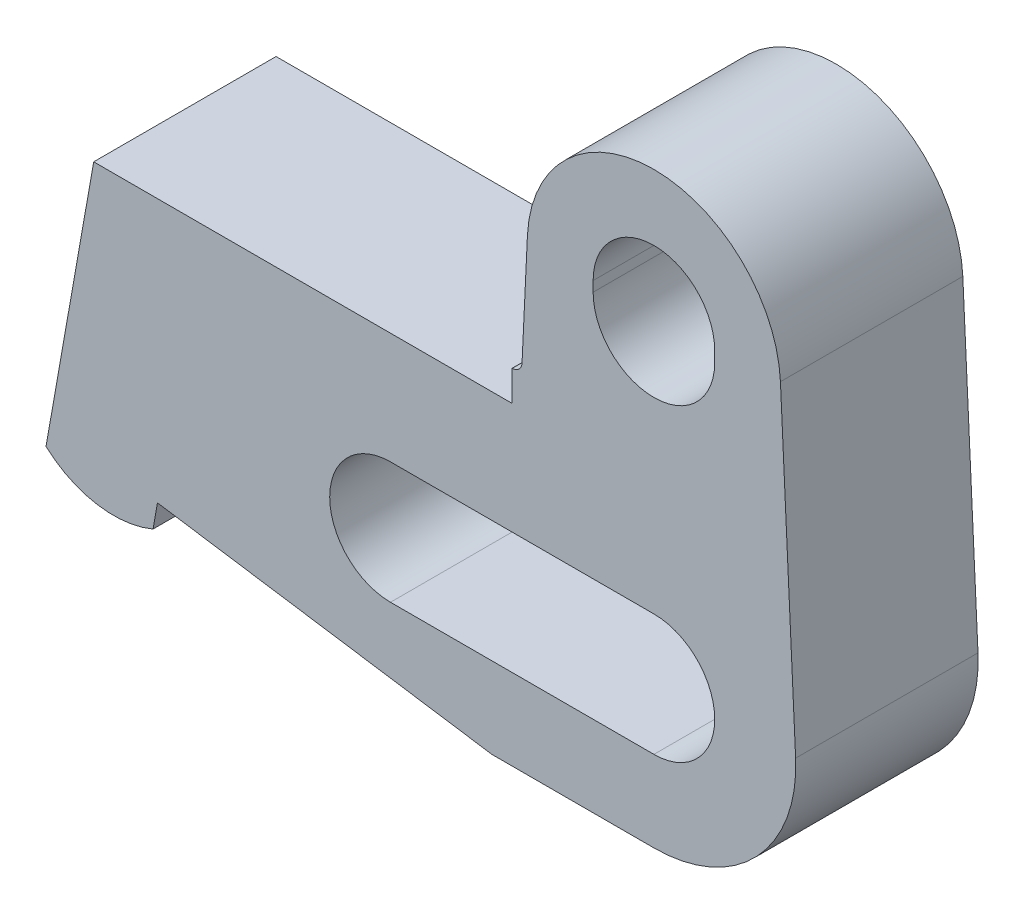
ISO-10303-21;
HEADER;
FILE_DESCRIPTION(('STEP AP214'),'2;1');
FILE_NAME('part.step','',(''),(''),'','','');
FILE_SCHEMA(('AUTOMOTIVE_DESIGN { 1 0 10303 214 1 1 1 1 }'));
ENDSEC;
DATA;
#1=APPLICATION_CONTEXT('core data for automotive mechanical design processes');
#2=APPLICATION_PROTOCOL_DEFINITION('international standard','automotive_design',2000,#1);
#3=PRODUCT_CONTEXT('',#1,'mechanical');
#4=PRODUCT('Part','Part','',(#3));
#5=PRODUCT_RELATED_PRODUCT_CATEGORY('part','',(#4));
#6=PRODUCT_DEFINITION_FORMATION('','',#4);
#7=PRODUCT_DEFINITION_CONTEXT('part definition',#1,'design');
#8=PRODUCT_DEFINITION('design','',#6,#7);
#9=PRODUCT_DEFINITION_SHAPE('','',#8);
#10=(LENGTH_UNIT() NAMED_UNIT(*) SI_UNIT(.MILLI.,.METRE.));
#11=(NAMED_UNIT(*) PLANE_ANGLE_UNIT() SI_UNIT($,.RADIAN.));
#12=(NAMED_UNIT(*) SI_UNIT($,.STERADIAN.) SOLID_ANGLE_UNIT());
#13=UNCERTAINTY_MEASURE_WITH_UNIT(LENGTH_MEASURE(1.E-05),#10,'distance_accuracy_value','');
#14=(GEOMETRIC_REPRESENTATION_CONTEXT(3) GLOBAL_UNCERTAINTY_ASSIGNED_CONTEXT((#13)) GLOBAL_UNIT_ASSIGNED_CONTEXT((#10,
#11,#12)) REPRESENTATION_CONTEXT('',''));
#15=CARTESIAN_POINT('',(0.,0.,0.));
#16=DIRECTION('',(0.,0.,1.));
#17=DIRECTION('',(1.,0.,0.));
#18=AXIS2_PLACEMENT_3D('',#15,#16,#17);
#19=CARTESIAN_POINT('',(-53.3249685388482,-2.25,9.));
#20=DIRECTION('',(0.,0.,1.));
#21=DIRECTION('',(1.,0.,0.));
#22=AXIS2_PLACEMENT_3D('',#19,#20,#21);
#23=PLANE('',#22);
#24=DIRECTION('',(1.,0.,0.));
#25=VECTOR('',#24,1.);
#26=CARTESIAN_POINT('',(-26.,-6.,9.));
#27=LINE('',#26,#25);
#28=CARTESIAN_POINT('',(-26.,-6.,9.));
#29=VERTEX_POINT('',#28);
#30=CARTESIAN_POINT('',(0.,-6.,9.));
#31=VERTEX_POINT('',#30);
#32=EDGE_CURVE('E213',#29,#31,#27,.T.);
#33=ORIENTED_EDGE('',*,*,#32,.F.);
#34=CARTESIAN_POINT('',(-26.,0.,9.));
#35=DIRECTION('',(0.,0.,1.));
#36=DIRECTION('',(1.,0.,0.));
#37=AXIS2_PLACEMENT_3D('',#34,#35,#36);
#38=CIRCLE('',#37,6.);
#39=CARTESIAN_POINT('',(-26.,6.,9.));
#40=VERTEX_POINT('',#39);
#41=EDGE_CURVE('E211',#40,#29,#38,.T.);
#42=ORIENTED_EDGE('',*,*,#41,.F.);
#43=DIRECTION('',(-1.,0.,0.));
#44=VECTOR('',#43,1.);
#45=CARTESIAN_POINT('',(-26.,6.,9.));
#46=LINE('',#45,#44);
#47=CARTESIAN_POINT('',(0.,6.,9.));
#48=VERTEX_POINT('',#47);
#49=EDGE_CURVE('E219',#48,#40,#46,.T.);
#50=ORIENTED_EDGE('',*,*,#49,.F.);
#51=CARTESIAN_POINT('',(0.,0.,9.));
#52=DIRECTION('',(0.,0.,1.));
#53=DIRECTION('',(1.,0.,0.));
#54=AXIS2_PLACEMENT_3D('',#51,#52,#53);
#55=CIRCLE('',#54,6.);
#56=EDGE_CURVE('E216',#31,#48,#55,.T.);
#57=ORIENTED_EDGE('',*,*,#56,.F.);
#58=EDGE_LOOP('',(#33,#42,#50,#57));
#59=FACE_BOUND('',#58,.T.);
#60=DIRECTION('',(0.988715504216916,-0.149805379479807,0.));
#61=VECTOR('',#60,1.);
#62=CARTESIAN_POINT('',(-16.,-14.000000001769,9.));
#63=LINE('',#62,#61);
#64=CARTESIAN_POINT('',(-49.,-9.,9.));
#65=VERTEX_POINT('',#64);
#66=CARTESIAN_POINT('',(-16.,-14.000000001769,9.));
#67=VERTEX_POINT('',#66);
#68=EDGE_CURVE('E242',#65,#67,#63,.T.);
#69=ORIENTED_EDGE('',*,*,#68,.T.);
#70=DIRECTION('',(1.,0.,0.));
#71=VECTOR('',#70,1.);
#72=CARTESIAN_POINT('',(0.,-14.000000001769,9.));
#73=LINE('',#72,#71);
#74=CARTESIAN_POINT('',(0.,-14.000000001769,9.));
#75=VERTEX_POINT('',#74);
#76=EDGE_CURVE('E245',#67,#75,#73,.T.);
#77=ORIENTED_EDGE('',*,*,#76,.T.);
#78=CARTESIAN_POINT('',(0.,0.,9.));
#79=DIRECTION('',(0.,0.,1.));
#80=DIRECTION('',(-1.,0.,0.));
#81=AXIS2_PLACEMENT_3D('',#78,#79,#80);
#82=CIRCLE('',#81,14.000000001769);
#83=CARTESIAN_POINT('',(13.9841179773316,0.666666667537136,9.));
#84=VERTEX_POINT('',#83);
#85=EDGE_CURVE('E248',#75,#84,#82,.T.);
#86=ORIENTED_EDGE('',*,*,#85,.T.);
#87=DIRECTION('',(-0.0476190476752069,0.998865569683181,0.));
#88=VECTOR('',#87,1.);
#89=CARTESIAN_POINT('',(12.4858196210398,32.0952380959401,9.));
#90=LINE('',#89,#88);
#91=CARTESIAN_POINT('',(12.4858196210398,32.0952380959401,9.));
#92=VERTEX_POINT('',#91);
#93=EDGE_CURVE('E250',#84,#92,#90,.T.);
#94=ORIENTED_EDGE('',*,*,#93,.T.);
#95=CARTESIAN_POINT('',(0.,31.5,9.));
#96=DIRECTION('',(0.,0.,1.));
#97=DIRECTION('',(1.,0.,0.));
#98=AXIS2_PLACEMENT_3D('',#95,#96,#97);
#99=CIRCLE('',#98,12.5);
#100=CARTESIAN_POINT('',(-12.4858196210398,32.0952380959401,9.));
#101=VERTEX_POINT('',#100);
#102=EDGE_CURVE('E252',#92,#101,#99,.T.);
#103=ORIENTED_EDGE('',*,*,#102,.T.);
#104=DIRECTION('',(-0.0476190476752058,-0.998865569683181,0.));
#105=VECTOR('',#104,1.);
#106=CARTESIAN_POINT('',(-13.0171277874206,20.9504239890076,9.));
#107=LINE('',#106,#105);
#108=CARTESIAN_POINT('',(-13.0171277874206,20.9504239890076,9.));
#109=VERTEX_POINT('',#108);
#110=EDGE_CURVE('E254',#101,#109,#107,.T.);
#111=ORIENTED_EDGE('',*,*,#110,.T.);
#112=CARTESIAN_POINT('',(-14.0159933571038,20.9980430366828,9.));
#113=DIRECTION('',(0.,0.,-1.));
#114=DIRECTION('',(-1.,0.,0.));
#115=AXIS2_PLACEMENT_3D('',#112,#113,#114);
#116=CIRCLE('',#115,1.);
#117=CARTESIAN_POINT('',(-13.9534625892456,20.,9.));
#118=VERTEX_POINT('',#117);
#119=EDGE_CURVE('E256',#109,#118,#116,.T.);
#120=ORIENTED_EDGE('',*,*,#119,.T.);
#121=DIRECTION('',(-1.,0.,0.));
#122=VECTOR('',#121,1.);
#123=CARTESIAN_POINT('',(-13.9534625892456,20.,9.));
#124=LINE('',#123,#122);
#125=CARTESIAN_POINT('',(-14.,20.,9.));
#126=VERTEX_POINT('',#125);
#127=EDGE_CURVE('E258',#118,#126,#124,.T.);
#128=ORIENTED_EDGE('',*,*,#127,.T.);
#129=DIRECTION('',(0.,-1.,0.));
#130=VECTOR('',#129,1.);
#131=CARTESIAN_POINT('',(-14.,17.,9.));
#132=LINE('',#131,#130);
#133=CARTESIAN_POINT('',(-14.,17.,9.));
#134=VERTEX_POINT('',#133);
#135=EDGE_CURVE('E260',#126,#134,#132,.T.);
#136=ORIENTED_EDGE('',*,*,#135,.T.);
#137=DIRECTION('',(-1.,0.,0.));
#138=VECTOR('',#137,1.);
#139=CARTESIAN_POINT('',(-55.2927626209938,17.,9.));
#140=LINE('',#139,#138);
#141=CARTESIAN_POINT('',(-55.2927626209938,17.,9.));
#142=VERTEX_POINT('',#141);
#143=EDGE_CURVE('E262',#134,#142,#140,.T.);
#144=ORIENTED_EDGE('',*,*,#143,.T.);
#145=DIRECTION('',(-0.173648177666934,-0.984807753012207,0.));
#146=VECTOR('',#145,1.);
#147=CARTESIAN_POINT('',(-55.2927626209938,17.,9.));
#148=LINE('',#147,#146);
#149=CARTESIAN_POINT('',(-60.,-9.69606976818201,9.));
#150=VERTEX_POINT('',#149);
#151=EDGE_CURVE('E264',#142,#150,#148,.T.);
#152=ORIENTED_EDGE('',*,*,#151,.T.);
#153=CARTESIAN_POINT('',(-53.3249685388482,-2.25,9.));
#154=DIRECTION('',(0.,0.,1.));
#155=DIRECTION('',(1.,0.,0.));
#156=AXIS2_PLACEMENT_3D('',#153,#154,#155);
#157=CIRCLE('',#156,10.);
#158=CARTESIAN_POINT('',(-49.4341204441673,-11.4620193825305,9.));
#159=VERTEX_POINT('',#158);
#160=EDGE_CURVE('E266',#150,#159,#157,.T.);
#161=ORIENTED_EDGE('',*,*,#160,.T.);
#162=DIRECTION('',(0.173648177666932,0.984807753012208,0.));
#163=VECTOR('',#162,1.);
#164=CARTESIAN_POINT('',(-49.,-9.,9.));
#165=LINE('',#164,#163);
#166=EDGE_CURVE('E269',#159,#65,#165,.T.);
#167=ORIENTED_EDGE('',*,*,#166,.T.);
#168=EDGE_LOOP('',(#69,#77,#86,#94,#103,#111,#120,#128,#136,#144,#152,#161,#167));
#169=FACE_BOUND('',#168,.T.);
#170=DIRECTION('',(0.,-1.,0.));
#171=VECTOR('',#170,1.);
#172=CARTESIAN_POINT('',(-5.99999999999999,31.5,9.));
#173=LINE('',#172,#171);
#174=CARTESIAN_POINT('',(-5.99999999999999,31.5,9.));
#175=VERTEX_POINT('',#174);
#176=CARTESIAN_POINT('',(-6.,30.5,9.));
#177=VERTEX_POINT('',#176);
#178=EDGE_CURVE('E183',#175,#177,#173,.T.);
#179=ORIENTED_EDGE('',*,*,#178,.F.);
#180=CARTESIAN_POINT('',(0.,31.5,9.));
#181=DIRECTION('',(0.,0.,1.));
#182=DIRECTION('',(1.,0.,0.));
#183=AXIS2_PLACEMENT_3D('',#180,#181,#182);
#184=CIRCLE('',#183,6.);
#185=CARTESIAN_POINT('',(5.99999999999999,31.5,9.));
#186=VERTEX_POINT('',#185);
#187=EDGE_CURVE('E175',#186,#175,#184,.T.);
#188=ORIENTED_EDGE('',*,*,#187,.F.);
#189=DIRECTION('',(0.,1.,0.));
#190=VECTOR('',#189,1.);
#191=CARTESIAN_POINT('',(5.99999999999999,31.5,9.));
#192=LINE('',#191,#190);
#193=CARTESIAN_POINT('',(6.,30.5,9.));
#194=VERTEX_POINT('',#193);
#195=EDGE_CURVE('E197',#194,#186,#192,.T.);
#196=ORIENTED_EDGE('',*,*,#195,.F.);
#197=CARTESIAN_POINT('',(0.,30.5,9.));
#198=DIRECTION('',(0.,0.,1.));
#199=DIRECTION('',(1.,0.,0.));
#200=AXIS2_PLACEMENT_3D('',#197,#198,#199);
#201=CIRCLE('',#200,6.);
#202=EDGE_CURVE('E195',#177,#194,#201,.T.);
#203=ORIENTED_EDGE('',*,*,#202,.F.);
#204=EDGE_LOOP('',(#179,#188,#196,#203));
#205=FACE_BOUND('',#204,.T.);
#206=ADVANCED_FACE('F32',(#59,#169,#205),#23,.T.);
#207=CARTESIAN_POINT('',(-53.3249685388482,-2.25,-9.));
#208=DIRECTION('',(0.,0.,1.));
#209=DIRECTION('',(1.,0.,0.));
#210=AXIS2_PLACEMENT_3D('',#207,#208,#209);
#211=PLANE('',#210);
#212=CARTESIAN_POINT('',(-26.,0.,-9.));
#213=DIRECTION('',(0.,0.,1.));
#214=DIRECTION('',(1.,0.,0.));
#215=AXIS2_PLACEMENT_3D('',#212,#213,#214);
#216=CIRCLE('',#215,6.);
#217=CARTESIAN_POINT('',(-26.,6.,-9.));
#218=VERTEX_POINT('',#217);
#219=CARTESIAN_POINT('',(-26.,-6.,-9.));
#220=VERTEX_POINT('',#219);
#221=EDGE_CURVE('E191',#218,#220,#216,.T.);
#222=ORIENTED_EDGE('',*,*,#221,.T.);
#223=DIRECTION('',(1.,0.,0.));
#224=VECTOR('',#223,1.);
#225=CARTESIAN_POINT('',(-26.,-6.,-9.));
#226=LINE('',#225,#224);
#227=CARTESIAN_POINT('',(0.,-6.,-9.));
#228=VERTEX_POINT('',#227);
#229=EDGE_CURVE('E224',#220,#228,#226,.T.);
#230=ORIENTED_EDGE('',*,*,#229,.T.);
#231=CARTESIAN_POINT('',(0.,0.,-9.));
#232=DIRECTION('',(0.,0.,1.));
#233=DIRECTION('',(1.,0.,0.));
#234=AXIS2_PLACEMENT_3D('',#231,#232,#233);
#235=CIRCLE('',#234,6.);
#236=CARTESIAN_POINT('',(0.,6.,-9.));
#237=VERTEX_POINT('',#236);
#238=EDGE_CURVE('E227',#228,#237,#235,.T.);
#239=ORIENTED_EDGE('',*,*,#238,.T.);
#240=DIRECTION('',(-1.,0.,0.));
#241=VECTOR('',#240,1.);
#242=CARTESIAN_POINT('',(-26.,6.,-9.));
#243=LINE('',#242,#241);
#244=EDGE_CURVE('E214',#237,#218,#243,.T.);
#245=ORIENTED_EDGE('',*,*,#244,.T.);
#246=EDGE_LOOP('',(#222,#230,#239,#245));
#247=FACE_BOUND('',#246,.T.);
#248=DIRECTION('',(0.988715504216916,-0.149805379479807,0.));
#249=VECTOR('',#248,1.);
#250=CARTESIAN_POINT('',(-16.,-14.000000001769,-9.));
#251=LINE('',#250,#249);
#252=CARTESIAN_POINT('',(-49.,-9.,-9.));
#253=VERTEX_POINT('',#252);
#254=CARTESIAN_POINT('',(-16.,-14.000000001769,-9.));
#255=VERTEX_POINT('',#254);
#256=EDGE_CURVE('E241',#253,#255,#251,.T.);
#257=ORIENTED_EDGE('',*,*,#256,.F.);
#258=DIRECTION('',(0.173648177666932,0.984807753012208,0.));
#259=VECTOR('',#258,1.);
#260=CARTESIAN_POINT('',(-49.,-9.,-9.));
#261=LINE('',#260,#259);
#262=CARTESIAN_POINT('',(-49.4341204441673,-11.4620193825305,-9.));
#263=VERTEX_POINT('',#262);
#264=EDGE_CURVE('E246',#263,#253,#261,.T.);
#265=ORIENTED_EDGE('',*,*,#264,.F.);
#266=CARTESIAN_POINT('',(-53.3249685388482,-2.25,-9.));
#267=DIRECTION('',(0.,0.,1.));
#268=DIRECTION('',(1.,0.,0.));
#269=AXIS2_PLACEMENT_3D('',#266,#267,#268);
#270=CIRCLE('',#269,10.);
#271=CARTESIAN_POINT('',(-60.,-9.69606976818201,-9.));
#272=VERTEX_POINT('',#271);
#273=EDGE_CURVE('E294',#272,#263,#270,.T.);
#274=ORIENTED_EDGE('',*,*,#273,.F.);
#275=DIRECTION('',(-0.173648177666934,-0.984807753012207,0.));
#276=VECTOR('',#275,1.);
#277=CARTESIAN_POINT('',(-55.2927626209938,17.,-9.));
#278=LINE('',#277,#276);
#279=CARTESIAN_POINT('',(-55.2927626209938,17.,-9.));
#280=VERTEX_POINT('',#279);
#281=EDGE_CURVE('E292',#280,#272,#278,.T.);
#282=ORIENTED_EDGE('',*,*,#281,.F.);
#283=DIRECTION('',(-1.,0.,0.));
#284=VECTOR('',#283,1.);
#285=CARTESIAN_POINT('',(-55.2927626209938,17.,-9.));
#286=LINE('',#285,#284);
#287=CARTESIAN_POINT('',(-14.,17.,-9.));
#288=VERTEX_POINT('',#287);
#289=EDGE_CURVE('E290',#288,#280,#286,.T.);
#290=ORIENTED_EDGE('',*,*,#289,.F.);
#291=DIRECTION('',(0.,-1.,0.));
#292=VECTOR('',#291,1.);
#293=CARTESIAN_POINT('',(-14.,17.,-9.));
#294=LINE('',#293,#292);
#295=CARTESIAN_POINT('',(-14.,20.,-9.));
#296=VERTEX_POINT('',#295);
#297=EDGE_CURVE('E288',#296,#288,#294,.T.);
#298=ORIENTED_EDGE('',*,*,#297,.F.);
#299=DIRECTION('',(-1.,0.,0.));
#300=VECTOR('',#299,1.);
#301=CARTESIAN_POINT('',(-13.9534625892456,20.,-9.));
#302=LINE('',#301,#300);
#303=CARTESIAN_POINT('',(-13.9534625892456,20.,-9.));
#304=VERTEX_POINT('',#303);
#305=EDGE_CURVE('E286',#304,#296,#302,.T.);
#306=ORIENTED_EDGE('',*,*,#305,.F.);
#307=CARTESIAN_POINT('',(-14.0159933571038,20.9980430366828,-9.));
#308=DIRECTION('',(0.,0.,-1.));
#309=DIRECTION('',(-1.,0.,0.));
#310=AXIS2_PLACEMENT_3D('',#307,#308,#309);
#311=CIRCLE('',#310,1.);
#312=CARTESIAN_POINT('',(-13.0171277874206,20.9504239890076,-9.));
#313=VERTEX_POINT('',#312);
#314=EDGE_CURVE('E284',#313,#304,#311,.T.);
#315=ORIENTED_EDGE('',*,*,#314,.F.);
#316=DIRECTION('',(-0.0476190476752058,-0.998865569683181,0.));
#317=VECTOR('',#316,1.);
#318=CARTESIAN_POINT('',(-13.0171277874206,20.9504239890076,-9.));
#319=LINE('',#318,#317);
#320=CARTESIAN_POINT('',(-12.4858196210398,32.0952380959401,-9.));
#321=VERTEX_POINT('',#320);
#322=EDGE_CURVE('E282',#321,#313,#319,.T.);
#323=ORIENTED_EDGE('',*,*,#322,.F.);
#324=CARTESIAN_POINT('',(0.,31.5,-9.));
#325=DIRECTION('',(0.,0.,1.));
#326=DIRECTION('',(1.,0.,0.));
#327=AXIS2_PLACEMENT_3D('',#324,#325,#326);
#328=CIRCLE('',#327,12.5);
#329=CARTESIAN_POINT('',(12.4858196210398,32.0952380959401,-9.));
#330=VERTEX_POINT('',#329);
#331=EDGE_CURVE('E280',#330,#321,#328,.T.);
#332=ORIENTED_EDGE('',*,*,#331,.F.);
#333=DIRECTION('',(-0.0476190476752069,0.998865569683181,0.));
#334=VECTOR('',#333,1.);
#335=CARTESIAN_POINT('',(12.4858196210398,32.0952380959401,-9.));
#336=LINE('',#335,#334);
#337=CARTESIAN_POINT('',(13.9841179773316,0.666666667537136,-9.));
#338=VERTEX_POINT('',#337);
#339=EDGE_CURVE('E278',#338,#330,#336,.T.);
#340=ORIENTED_EDGE('',*,*,#339,.F.);
#341=CARTESIAN_POINT('',(0.,0.,-9.));
#342=DIRECTION('',(0.,0.,1.));
#343=DIRECTION('',(-1.,0.,0.));
#344=AXIS2_PLACEMENT_3D('',#341,#342,#343);
#345=CIRCLE('',#344,14.000000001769);
#346=CARTESIAN_POINT('',(0.,-14.000000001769,-9.));
#347=VERTEX_POINT('',#346);
#348=EDGE_CURVE('E276',#347,#338,#345,.T.);
#349=ORIENTED_EDGE('',*,*,#348,.F.);
#350=DIRECTION('',(1.,0.,0.));
#351=VECTOR('',#350,1.);
#352=CARTESIAN_POINT('',(0.,-14.000000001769,-9.));
#353=LINE('',#352,#351);
#354=EDGE_CURVE('E274',#255,#347,#353,.T.);
#355=ORIENTED_EDGE('',*,*,#354,.F.);
#356=EDGE_LOOP('',(#257,#265,#274,#282,#290,#298,#306,#315,#323,#332,#340,#349,#355));
#357=FACE_BOUND('',#356,.T.);
#358=CARTESIAN_POINT('',(0.,31.5,-9.));
#359=DIRECTION('',(0.,0.,1.));
#360=DIRECTION('',(1.,0.,0.));
#361=AXIS2_PLACEMENT_3D('',#358,#359,#360);
#362=CIRCLE('',#361,6.);
#363=CARTESIAN_POINT('',(6.,31.5,-9.));
#364=VERTEX_POINT('',#363);
#365=CARTESIAN_POINT('',(-5.99999999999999,31.5,-9.));
#366=VERTEX_POINT('',#365);
#367=EDGE_CURVE('E55',#364,#366,#362,.T.);
#368=ORIENTED_EDGE('',*,*,#367,.T.);
#369=DIRECTION('',(0.,-1.,0.));
#370=VECTOR('',#369,1.);
#371=CARTESIAN_POINT('',(-5.99999999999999,31.5,-9.));
#372=LINE('',#371,#370);
#373=CARTESIAN_POINT('',(-6.,30.5,-9.));
#374=VERTEX_POINT('',#373);
#375=EDGE_CURVE('E190',#366,#374,#372,.T.);
#376=ORIENTED_EDGE('',*,*,#375,.T.);
#377=CARTESIAN_POINT('',(0.,30.5,-9.));
#378=DIRECTION('',(0.,0.,1.));
#379=DIRECTION('',(1.,0.,0.));
#380=AXIS2_PLACEMENT_3D('',#377,#378,#379);
#381=CIRCLE('',#380,6.);
#382=CARTESIAN_POINT('',(6.,30.5,-9.));
#383=VERTEX_POINT('',#382);
#384=EDGE_CURVE('E203',#374,#383,#381,.T.);
#385=ORIENTED_EDGE('',*,*,#384,.T.);
#386=DIRECTION('',(0.,1.,0.));
#387=VECTOR('',#386,1.);
#388=CARTESIAN_POINT('',(5.99999999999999,31.5,-9.));
#389=LINE('',#388,#387);
#390=EDGE_CURVE('E184',#383,#364,#389,.T.);
#391=ORIENTED_EDGE('',*,*,#390,.T.);
#392=EDGE_LOOP('',(#368,#376,#385,#391));
#393=FACE_BOUND('',#392,.T.);
#394=ADVANCED_FACE('F339',(#247,#357,#393),#211,.F.);
#395=CARTESIAN_POINT('',(-16.,-14.000000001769,9.));
#396=DIRECTION('',(0.149805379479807,0.988715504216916,0.));
#397=DIRECTION('',(-0.988715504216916,0.149805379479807,0.));
#398=AXIS2_PLACEMENT_3D('',#395,#396,#397);
#399=PLANE('',#398);
#400=ORIENTED_EDGE('',*,*,#256,.T.);
#401=DIRECTION('',(0.,0.,-1.));
#402=VECTOR('',#401,1.);
#403=CARTESIAN_POINT('',(-16.,-14.000000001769,9.));
#404=LINE('',#403,#402);
#405=EDGE_CURVE('E11',#67,#255,#404,.T.);
#406=ORIENTED_EDGE('',*,*,#405,.F.);
#407=ORIENTED_EDGE('',*,*,#68,.F.);
#408=DIRECTION('',(0.,0.,-1.));
#409=VECTOR('',#408,1.);
#410=CARTESIAN_POINT('',(-49.,-9.,9.));
#411=LINE('',#410,#409);
#412=EDGE_CURVE('E271',#65,#253,#411,.T.);
#413=ORIENTED_EDGE('',*,*,#412,.T.);
#414=EDGE_LOOP('',(#400,#406,#407,#413));
#415=FACE_BOUND('',#414,.T.);
#416=ADVANCED_FACE('F34',(#415),#399,.F.);
#417=CARTESIAN_POINT('',(0.,-14.000000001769,9.));
#418=DIRECTION('',(0.,1.,0.));
#419=DIRECTION('',(0.,0.,1.));
#420=AXIS2_PLACEMENT_3D('',#417,#418,#419);
#421=PLANE('',#420);
#422=ORIENTED_EDGE('',*,*,#354,.T.);
#423=DIRECTION('',(0.,0.,-1.));
#424=VECTOR('',#423,1.);
#425=CARTESIAN_POINT('',(0.,-14.000000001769,9.));
#426=LINE('',#425,#424);
#427=EDGE_CURVE('E40',#75,#347,#426,.T.);
#428=ORIENTED_EDGE('',*,*,#427,.F.);
#429=ORIENTED_EDGE('',*,*,#76,.F.);
#430=ORIENTED_EDGE('',*,*,#405,.T.);
#431=EDGE_LOOP('',(#422,#428,#429,#430));
#432=FACE_BOUND('',#431,.T.);
#433=ADVANCED_FACE('F356',(#432),#421,.F.);
#434=CARTESIAN_POINT('',(0.,0.,9.));
#435=DIRECTION('',(0.,0.,-1.));
#436=DIRECTION('',(-1.,0.,0.));
#437=AXIS2_PLACEMENT_3D('',#434,#435,#436);
#438=CYLINDRICAL_SURFACE('',#437,14.000000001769);
#439=ORIENTED_EDGE('',*,*,#348,.T.);
#440=DIRECTION('',(0.,0.,-1.));
#441=VECTOR('',#440,1.);
#442=CARTESIAN_POINT('',(13.9841179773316,0.666666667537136,9.));
#443=LINE('',#442,#441);
#444=EDGE_CURVE('E326',#84,#338,#443,.T.);
#445=ORIENTED_EDGE('',*,*,#444,.F.);
#446=ORIENTED_EDGE('',*,*,#85,.F.);
#447=ORIENTED_EDGE('',*,*,#427,.T.);
#448=EDGE_LOOP('',(#439,#445,#446,#447));
#449=FACE_BOUND('',#448,.T.);
#450=ADVANCED_FACE('F333',(#449),#438,.T.);
#451=CARTESIAN_POINT('',(12.4858196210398,32.0952380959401,9.));
#452=DIRECTION('',(-0.998865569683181,-0.0476190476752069,0.));
#453=DIRECTION('',(0.0476190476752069,-0.998865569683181,0.));
#454=AXIS2_PLACEMENT_3D('',#451,#452,#453);
#455=PLANE('',#454);
#456=ORIENTED_EDGE('',*,*,#339,.T.);
#457=DIRECTION('',(0.,0.,-1.));
#458=VECTOR('',#457,1.);
#459=CARTESIAN_POINT('',(12.4858196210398,32.0952380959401,9.));
#460=LINE('',#459,#458);
#461=EDGE_CURVE('E323',#92,#330,#460,.T.);
#462=ORIENTED_EDGE('',*,*,#461,.F.);
#463=ORIENTED_EDGE('',*,*,#93,.F.);
#464=ORIENTED_EDGE('',*,*,#444,.T.);
#465=EDGE_LOOP('',(#456,#462,#463,#464));
#466=FACE_BOUND('',#465,.T.);
#467=ADVANCED_FACE('F345',(#466),#455,.F.);
#468=CARTESIAN_POINT('',(0.,31.5,9.));
#469=DIRECTION('',(0.,0.,-1.));
#470=DIRECTION('',(-1.,0.,0.));
#471=AXIS2_PLACEMENT_3D('',#468,#469,#470);
#472=CYLINDRICAL_SURFACE('',#471,12.5);
#473=ORIENTED_EDGE('',*,*,#331,.T.);
#474=DIRECTION('',(0.,0.,-1.));
#475=VECTOR('',#474,1.);
#476=CARTESIAN_POINT('',(-12.4858196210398,32.0952380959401,9.));
#477=LINE('',#476,#475);
#478=EDGE_CURVE('E320',#101,#321,#477,.T.);
#479=ORIENTED_EDGE('',*,*,#478,.F.);
#480=ORIENTED_EDGE('',*,*,#102,.F.);
#481=ORIENTED_EDGE('',*,*,#461,.T.);
#482=EDGE_LOOP('',(#473,#479,#480,#481));
#483=FACE_BOUND('',#482,.T.);
#484=ADVANCED_FACE('F349',(#483),#472,.T.);
#485=CARTESIAN_POINT('',(-13.0171277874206,20.9504239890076,9.));
#486=DIRECTION('',(0.998865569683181,-0.0476190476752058,0.));
#487=DIRECTION('',(0.0476190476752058,0.998865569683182,0.));
#488=AXIS2_PLACEMENT_3D('',#485,#486,#487);
#489=PLANE('',#488);
#490=ORIENTED_EDGE('',*,*,#322,.T.);
#491=DIRECTION('',(0.,0.,-1.));
#492=VECTOR('',#491,1.);
#493=CARTESIAN_POINT('',(-13.0171277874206,20.9504239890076,9.));
#494=LINE('',#493,#492);
#495=EDGE_CURVE('E317',#109,#313,#494,.T.);
#496=ORIENTED_EDGE('',*,*,#495,.F.);
#497=ORIENTED_EDGE('',*,*,#110,.F.);
#498=ORIENTED_EDGE('',*,*,#478,.T.);
#499=EDGE_LOOP('',(#490,#496,#497,#498));
#500=FACE_BOUND('',#499,.T.);
#501=ADVANCED_FACE('F394',(#500),#489,.F.);
#502=CARTESIAN_POINT('',(-14.0159933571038,20.9980430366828,9.));
#503=DIRECTION('',(0.,0.,-1.));
#504=DIRECTION('',(-1.,0.,0.));
#505=AXIS2_PLACEMENT_3D('',#502,#503,#504);
#506=CYLINDRICAL_SURFACE('',#505,1.);
#507=ORIENTED_EDGE('',*,*,#314,.T.);
#508=DIRECTION('',(0.,0.,-1.));
#509=VECTOR('',#508,1.);
#510=CARTESIAN_POINT('',(-13.9534625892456,20.,9.));
#511=LINE('',#510,#509);
#512=EDGE_CURVE('E314',#118,#304,#511,.T.);
#513=ORIENTED_EDGE('',*,*,#512,.F.);
#514=ORIENTED_EDGE('',*,*,#119,.F.);
#515=ORIENTED_EDGE('',*,*,#495,.T.);
#516=EDGE_LOOP('',(#507,#513,#514,#515));
#517=FACE_BOUND('',#516,.T.);
#518=ADVANCED_FACE('F391',(#517),#506,.F.);
#519=CARTESIAN_POINT('',(-13.9534625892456,20.,9.));
#520=DIRECTION('',(0.,-1.,0.));
#521=DIRECTION('',(0.,0.,-1.));
#522=AXIS2_PLACEMENT_3D('',#519,#520,#521);
#523=PLANE('',#522);
#524=ORIENTED_EDGE('',*,*,#305,.T.);
#525=DIRECTION('',(0.,0.,-1.));
#526=VECTOR('',#525,1.);
#527=CARTESIAN_POINT('',(-14.,20.,9.));
#528=LINE('',#527,#526);
#529=EDGE_CURVE('E311',#126,#296,#528,.T.);
#530=ORIENTED_EDGE('',*,*,#529,.F.);
#531=ORIENTED_EDGE('',*,*,#127,.F.);
#532=ORIENTED_EDGE('',*,*,#512,.T.);
#533=EDGE_LOOP('',(#524,#530,#531,#532));
#534=FACE_BOUND('',#533,.T.);
#535=ADVANCED_FACE('F387',(#534),#523,.F.);
#536=CARTESIAN_POINT('',(-14.,17.,9.));
#537=DIRECTION('',(1.,0.,0.));
#538=DIRECTION('',(0.,1.,0.));
#539=AXIS2_PLACEMENT_3D('',#536,#537,#538);
#540=PLANE('',#539);
#541=ORIENTED_EDGE('',*,*,#297,.T.);
#542=DIRECTION('',(0.,0.,-1.));
#543=VECTOR('',#542,1.);
#544=CARTESIAN_POINT('',(-14.,17.,9.));
#545=LINE('',#544,#543);
#546=EDGE_CURVE('E308',#134,#288,#545,.T.);
#547=ORIENTED_EDGE('',*,*,#546,.F.);
#548=ORIENTED_EDGE('',*,*,#135,.F.);
#549=ORIENTED_EDGE('',*,*,#529,.T.);
#550=EDGE_LOOP('',(#541,#547,#548,#549));
#551=FACE_BOUND('',#550,.T.);
#552=ADVANCED_FACE('F383',(#551),#540,.F.);
#553=CARTESIAN_POINT('',(-55.2927626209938,17.,9.));
#554=DIRECTION('',(0.,-1.,0.));
#555=DIRECTION('',(0.,0.,-1.));
#556=AXIS2_PLACEMENT_3D('',#553,#554,#555);
#557=PLANE('',#556);
#558=ORIENTED_EDGE('',*,*,#289,.T.);
#559=DIRECTION('',(0.,0.,-1.));
#560=VECTOR('',#559,1.);
#561=CARTESIAN_POINT('',(-55.2927626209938,17.,9.));
#562=LINE('',#561,#560);
#563=EDGE_CURVE('E305',#142,#280,#562,.T.);
#564=ORIENTED_EDGE('',*,*,#563,.F.);
#565=ORIENTED_EDGE('',*,*,#143,.F.);
#566=ORIENTED_EDGE('',*,*,#546,.T.);
#567=EDGE_LOOP('',(#558,#564,#565,#566));
#568=FACE_BOUND('',#567,.T.);
#569=ADVANCED_FACE('F378',(#568),#557,.F.);
#570=CARTESIAN_POINT('',(-55.2927626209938,17.,9.));
#571=DIRECTION('',(0.984807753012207,-0.173648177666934,0.));
#572=DIRECTION('',(0.173648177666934,0.984807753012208,0.));
#573=AXIS2_PLACEMENT_3D('',#570,#571,#572);
#574=PLANE('',#573);
#575=ORIENTED_EDGE('',*,*,#281,.T.);
#576=DIRECTION('',(0.,0.,-1.));
#577=VECTOR('',#576,1.);
#578=CARTESIAN_POINT('',(-60.,-9.69606976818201,9.));
#579=LINE('',#578,#577);
#580=EDGE_CURVE('E302',#150,#272,#579,.T.);
#581=ORIENTED_EDGE('',*,*,#580,.F.);
#582=ORIENTED_EDGE('',*,*,#151,.F.);
#583=ORIENTED_EDGE('',*,*,#563,.T.);
#584=EDGE_LOOP('',(#575,#581,#582,#583));
#585=FACE_BOUND('',#584,.T.);
#586=ADVANCED_FACE('F372',(#585),#574,.F.);
#587=CARTESIAN_POINT('',(-53.3249685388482,-2.25,9.));
#588=DIRECTION('',(0.,0.,-1.));
#589=DIRECTION('',(-1.,0.,0.));
#590=AXIS2_PLACEMENT_3D('',#587,#588,#589);
#591=CYLINDRICAL_SURFACE('',#590,10.);
#592=ORIENTED_EDGE('',*,*,#273,.T.);
#593=DIRECTION('',(0.,0.,-1.));
#594=VECTOR('',#593,1.);
#595=CARTESIAN_POINT('',(-49.4341204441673,-11.4620193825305,9.));
#596=LINE('',#595,#594);
#597=EDGE_CURVE('E299',#159,#263,#596,.T.);
#598=ORIENTED_EDGE('',*,*,#597,.F.);
#599=ORIENTED_EDGE('',*,*,#160,.F.);
#600=ORIENTED_EDGE('',*,*,#580,.T.);
#601=EDGE_LOOP('',(#592,#598,#599,#600));
#602=FACE_BOUND('',#601,.T.);
#603=ADVANCED_FACE('F368',(#602),#591,.T.);
#604=CARTESIAN_POINT('',(-49.,-9.,9.));
#605=DIRECTION('',(-0.984807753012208,0.173648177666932,0.));
#606=DIRECTION('',(-0.173648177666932,-0.984807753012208,0.));
#607=AXIS2_PLACEMENT_3D('',#604,#605,#606);
#608=PLANE('',#607);
#609=ORIENTED_EDGE('',*,*,#264,.T.);
#610=ORIENTED_EDGE('',*,*,#412,.F.);
#611=ORIENTED_EDGE('',*,*,#166,.F.);
#612=ORIENTED_EDGE('',*,*,#597,.T.);
#613=EDGE_LOOP('',(#609,#610,#611,#612));
#614=FACE_BOUND('',#613,.T.);
#615=ADVANCED_FACE('F363',(#614),#608,.F.);
#616=CARTESIAN_POINT('',(-26.,0.,9.));
#617=DIRECTION('',(0.,0.,-1.));
#618=DIRECTION('',(-1.,0.,0.));
#619=AXIS2_PLACEMENT_3D('',#616,#617,#618);
#620=CYLINDRICAL_SURFACE('',#619,6.);
#621=ORIENTED_EDGE('',*,*,#221,.F.);
#622=DIRECTION('',(0.,0.,-1.));
#623=VECTOR('',#622,1.);
#624=CARTESIAN_POINT('',(-26.,6.,9.));
#625=LINE('',#624,#623);
#626=EDGE_CURVE('E221',#40,#218,#625,.T.);
#627=ORIENTED_EDGE('',*,*,#626,.F.);
#628=ORIENTED_EDGE('',*,*,#41,.T.);
#629=DIRECTION('',(0.,0.,-1.));
#630=VECTOR('',#629,1.);
#631=CARTESIAN_POINT('',(-26.,-6.,9.));
#632=LINE('',#631,#630);
#633=EDGE_CURVE('E238',#29,#220,#632,.T.);
#634=ORIENTED_EDGE('',*,*,#633,.T.);
#635=EDGE_LOOP('',(#621,#627,#628,#634));
#636=FACE_BOUND('',#635,.T.);
#637=ADVANCED_FACE('F413',(#636),#620,.F.);
#638=CARTESIAN_POINT('',(-26.,-6.,9.));
#639=DIRECTION('',(0.,1.,0.));
#640=DIRECTION('',(0.,0.,1.));
#641=AXIS2_PLACEMENT_3D('',#638,#639,#640);
#642=PLANE('',#641);
#643=ORIENTED_EDGE('',*,*,#229,.F.);
#644=ORIENTED_EDGE('',*,*,#633,.F.);
#645=ORIENTED_EDGE('',*,*,#32,.T.);
#646=DIRECTION('',(0.,0.,-1.));
#647=VECTOR('',#646,1.);
#648=CARTESIAN_POINT('',(0.,-6.,9.));
#649=LINE('',#648,#647);
#650=EDGE_CURVE('E236',#31,#228,#649,.T.);
#651=ORIENTED_EDGE('',*,*,#650,.T.);
#652=EDGE_LOOP('',(#643,#644,#645,#651));
#653=FACE_BOUND('',#652,.T.);
#654=ADVANCED_FACE('F457',(#653),#642,.T.);
#655=CARTESIAN_POINT('',(0.,0.,9.));
#656=DIRECTION('',(0.,0.,-1.));
#657=DIRECTION('',(-1.,0.,0.));
#658=AXIS2_PLACEMENT_3D('',#655,#656,#657);
#659=CYLINDRICAL_SURFACE('',#658,6.);
#660=ORIENTED_EDGE('',*,*,#238,.F.);
#661=ORIENTED_EDGE('',*,*,#650,.F.);
#662=ORIENTED_EDGE('',*,*,#56,.T.);
#663=DIRECTION('',(0.,0.,-1.));
#664=VECTOR('',#663,1.);
#665=CARTESIAN_POINT('',(0.,6.,9.));
#666=LINE('',#665,#664);
#667=EDGE_CURVE('E234',#48,#237,#666,.T.);
#668=ORIENTED_EDGE('',*,*,#667,.T.);
#669=EDGE_LOOP('',(#660,#661,#662,#668));
#670=FACE_BOUND('',#669,.T.);
#671=ADVANCED_FACE('F464',(#670),#659,.F.);
#672=CARTESIAN_POINT('',(-26.,6.,9.));
#673=DIRECTION('',(0.,-1.,0.));
#674=DIRECTION('',(0.,0.,-1.));
#675=AXIS2_PLACEMENT_3D('',#672,#673,#674);
#676=PLANE('',#675);
#677=ORIENTED_EDGE('',*,*,#244,.F.);
#678=ORIENTED_EDGE('',*,*,#667,.F.);
#679=ORIENTED_EDGE('',*,*,#49,.T.);
#680=ORIENTED_EDGE('',*,*,#626,.T.);
#681=EDGE_LOOP('',(#677,#678,#679,#680));
#682=FACE_BOUND('',#681,.T.);
#683=ADVANCED_FACE('F471',(#682),#676,.T.);
#684=CARTESIAN_POINT('',(0.,31.5,9.));
#685=DIRECTION('',(0.,0.,-1.));
#686=DIRECTION('',(-1.,0.,0.));
#687=AXIS2_PLACEMENT_3D('',#684,#685,#686);
#688=CYLINDRICAL_SURFACE('',#687,6.);
#689=ORIENTED_EDGE('',*,*,#367,.F.);
#690=DIRECTION('',(0.,0.,-1.));
#691=VECTOR('',#690,1.);
#692=CARTESIAN_POINT('',(5.99999999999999,31.5,9.));
#693=LINE('',#692,#691);
#694=EDGE_CURVE('E179',#186,#364,#693,.T.);
#695=ORIENTED_EDGE('',*,*,#694,.F.);
#696=ORIENTED_EDGE('',*,*,#187,.T.);
#697=DIRECTION('',(0.,0.,-1.));
#698=VECTOR('',#697,1.);
#699=CARTESIAN_POINT('',(-5.99999999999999,31.5,9.));
#700=LINE('',#699,#698);
#701=EDGE_CURVE('E178',#175,#366,#700,.T.);
#702=ORIENTED_EDGE('',*,*,#701,.T.);
#703=EDGE_LOOP('',(#689,#695,#696,#702));
#704=FACE_BOUND('',#703,.T.);
#705=ADVANCED_FACE('F177',(#704),#688,.F.);
#706=CARTESIAN_POINT('',(-5.99999999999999,31.5,9.));
#707=DIRECTION('',(1.,0.,0.));
#708=DIRECTION('',(0.,1.,0.));
#709=AXIS2_PLACEMENT_3D('',#706,#707,#708);
#710=PLANE('',#709);
#711=ORIENTED_EDGE('',*,*,#375,.F.);
#712=ORIENTED_EDGE('',*,*,#701,.F.);
#713=ORIENTED_EDGE('',*,*,#178,.T.);
#714=DIRECTION('',(0.,0.,-1.));
#715=VECTOR('',#714,1.);
#716=CARTESIAN_POINT('',(-6.,30.5,9.));
#717=LINE('',#716,#715);
#718=EDGE_CURVE('E192',#177,#374,#717,.T.);
#719=ORIENTED_EDGE('',*,*,#718,.T.);
#720=EDGE_LOOP('',(#711,#712,#713,#719));
#721=FACE_BOUND('',#720,.T.);
#722=ADVANCED_FACE('F187',(#721),#710,.T.);
#723=CARTESIAN_POINT('',(0.,30.5,9.));
#724=DIRECTION('',(0.,0.,-1.));
#725=DIRECTION('',(-1.,0.,0.));
#726=AXIS2_PLACEMENT_3D('',#723,#724,#725);
#727=CYLINDRICAL_SURFACE('',#726,6.);
#728=ORIENTED_EDGE('',*,*,#384,.F.);
#729=ORIENTED_EDGE('',*,*,#718,.F.);
#730=ORIENTED_EDGE('',*,*,#202,.T.);
#731=DIRECTION('',(0.,0.,-1.));
#732=VECTOR('',#731,1.);
#733=CARTESIAN_POINT('',(6.,30.5,9.));
#734=LINE('',#733,#732);
#735=EDGE_CURVE('E47',#194,#383,#734,.T.);
#736=ORIENTED_EDGE('',*,*,#735,.T.);
#737=EDGE_LOOP('',(#728,#729,#730,#736));
#738=FACE_BOUND('',#737,.T.);
#739=ADVANCED_FACE('F492',(#738),#727,.F.);
#740=CARTESIAN_POINT('',(5.99999999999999,31.5,9.));
#741=DIRECTION('',(-1.,0.,0.));
#742=DIRECTION('',(0.,-1.,0.));
#743=AXIS2_PLACEMENT_3D('',#740,#741,#742);
#744=PLANE('',#743);
#745=ORIENTED_EDGE('',*,*,#390,.F.);
#746=ORIENTED_EDGE('',*,*,#735,.F.);
#747=ORIENTED_EDGE('',*,*,#195,.T.);
#748=ORIENTED_EDGE('',*,*,#694,.T.);
#749=EDGE_LOOP('',(#745,#746,#747,#748));
#750=FACE_BOUND('',#749,.T.);
#751=ADVANCED_FACE('F499',(#750),#744,.T.);
#752=CLOSED_SHELL('',(#206,#394,#416,#433,#450,#467,#484,#501,#518,#535,#552,#569,#586,#603,
#615,#637,#654,#671,#683,#705,#722,#739,#751));
#753=MANIFOLD_SOLID_BREP('B2',#752);
#754=ADVANCED_BREP_SHAPE_REPRESENTATION('',(#18,#753),#14);
#755=SHAPE_DEFINITION_REPRESENTATION(#9,#754);
ENDSEC;
END-ISO-10303-21;
